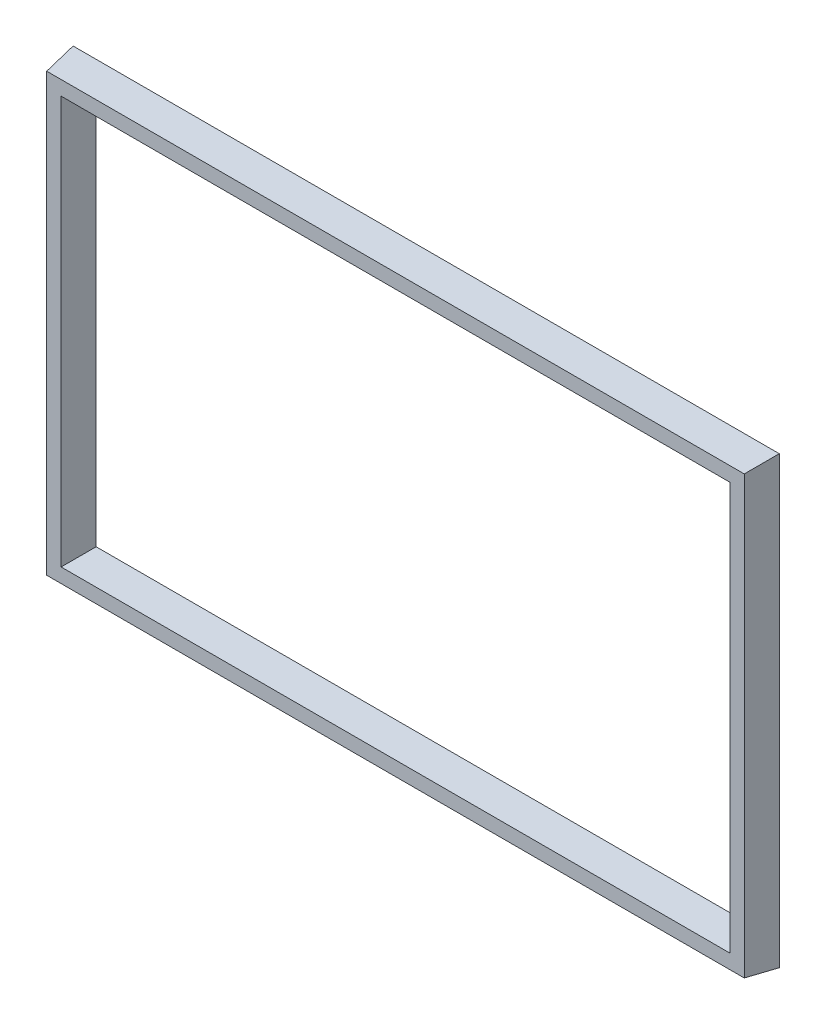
from build123d import *

# Parameters (mm, degrees)
SKETCH1_W           = 46
SKETCH1_H           = 29
SKETCH1_W_2         = 43
SKETCH1_H_2         = 26
BOSS_EXTRUDE1_DEPTH = 2
BOSS_EXTRUDE1_DRAFT = 8


with BuildPart() as part:
    # Sketch1 → Boss-Extrude1 (with draft: the straight prism first)
    with BuildSketch(Plane.XY):
        with Locations((35, -13)):
            Rectangle(SKETCH1_W, SKETCH1_H)
        with Locations((35, -13)):
            Rectangle(SKETCH1_W_2, SKETCH1_H_2, mode=Mode.SUBTRACT)
    extrude(amount=BOSS_EXTRUDE1_DEPTH)
    # Boss-Extrude1: the draft: its side faces are tilted about the plane it starts from
    boss_extrude1_sides = [part.faces().sort_by_distance(p)[0] for p in [
        (58, -13, 1),
        (35, 1.5, 1),
        (12, -13, 1),
        (35, -27.5, 1),
        (35, 0, 1),
        (56.5, -13, 1),
        (35, -26, 1),
        (13.5, -13, 1),
    ]]
    draft(boss_extrude1_sides, Plane.XY, BOSS_EXTRUDE1_DRAFT)


solid = part.part
